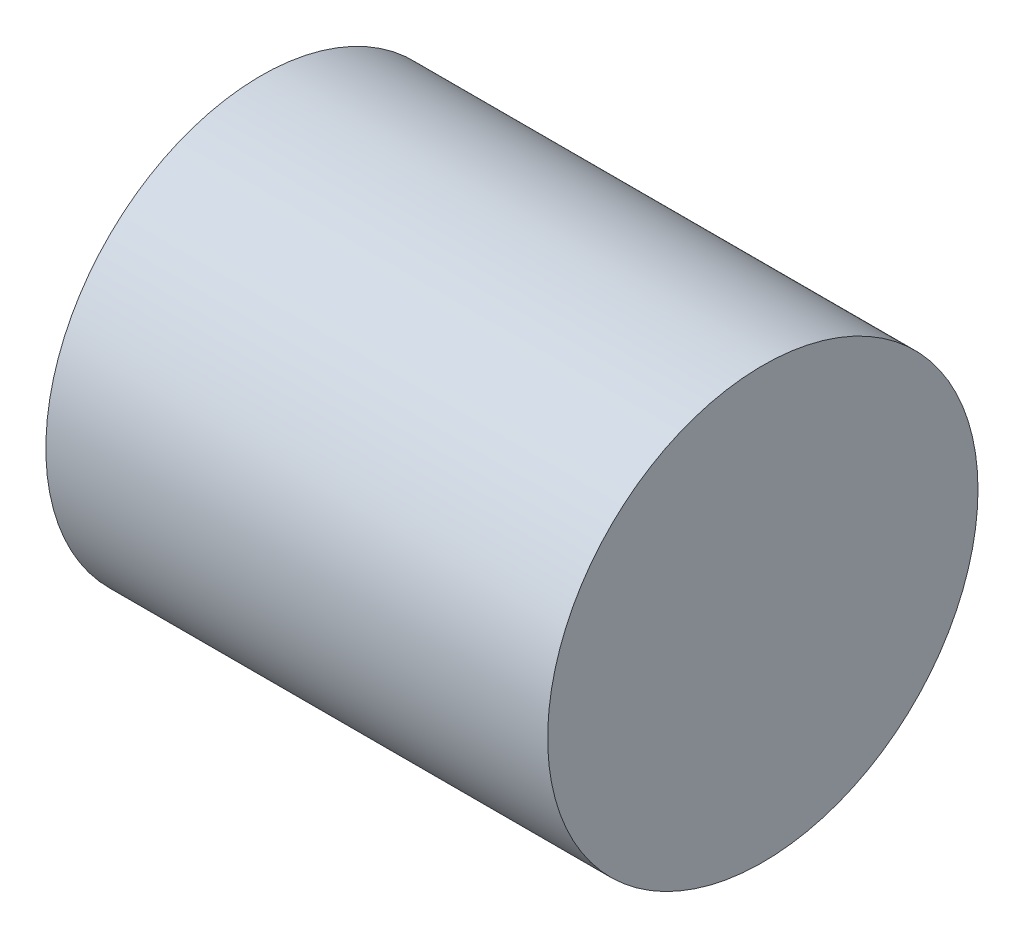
ISO-10303-21;
HEADER;
FILE_DESCRIPTION(('STEP AP214'),'2;1');
FILE_NAME('part.step','',(''),(''),'','','');
FILE_SCHEMA(('AUTOMOTIVE_DESIGN { 1 0 10303 214 1 1 1 1 }'));
ENDSEC;
DATA;
#1=APPLICATION_CONTEXT('core data for automotive mechanical design processes');
#2=APPLICATION_PROTOCOL_DEFINITION('international standard','automotive_design',2000,#1);
#3=PRODUCT_CONTEXT('',#1,'mechanical');
#4=PRODUCT('Part','Part','',(#3));
#5=PRODUCT_RELATED_PRODUCT_CATEGORY('part','',(#4));
#6=PRODUCT_DEFINITION_FORMATION('','',#4);
#7=PRODUCT_DEFINITION_CONTEXT('part definition',#1,'design');
#8=PRODUCT_DEFINITION('design','',#6,#7);
#9=PRODUCT_DEFINITION_SHAPE('','',#8);
#10=(LENGTH_UNIT() NAMED_UNIT(*) SI_UNIT(.MILLI.,.METRE.));
#11=(NAMED_UNIT(*) PLANE_ANGLE_UNIT() SI_UNIT($,.RADIAN.));
#12=(NAMED_UNIT(*) SI_UNIT($,.STERADIAN.) SOLID_ANGLE_UNIT());
#13=UNCERTAINTY_MEASURE_WITH_UNIT(LENGTH_MEASURE(1.E-05),#10,'distance_accuracy_value','');
#14=(GEOMETRIC_REPRESENTATION_CONTEXT(3) GLOBAL_UNCERTAINTY_ASSIGNED_CONTEXT((#13)) GLOBAL_UNIT_ASSIGNED_CONTEXT((#10,
#11,#12)) REPRESENTATION_CONTEXT('',''));
#15=CARTESIAN_POINT('',(0.,0.,0.));
#16=DIRECTION('',(0.,0.,1.));
#17=DIRECTION('',(1.,0.,0.));
#18=AXIS2_PLACEMENT_3D('',#15,#16,#17);
#19=CARTESIAN_POINT('',(9.230000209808,0.,4.8));
#20=DIRECTION('',(1.,0.,0.));
#21=DIRECTION('',(0.,0.,-1.));
#22=AXIS2_PLACEMENT_3D('',#19,#20,#21);
#23=PLANE('',#22);
#24=CARTESIAN_POINT('',(9.230000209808,0.,4.8));
#25=DIRECTION('',(1.,0.,0.));
#26=DIRECTION('',(0.,0.,-1.));
#27=AXIS2_PLACEMENT_3D('',#24,#25,#26);
#28=CIRCLE('',#27,2.799999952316);
#29=CARTESIAN_POINT('',(9.230000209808,0.,2.000000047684));
#30=VERTEX_POINT('',#29);
#31=EDGE_CURVE('E17',#30,#30,#28,.F.);
#32=ORIENTED_EDGE('',*,*,#31,.F.);
#33=EDGE_LOOP('',(#32));
#34=FACE_BOUND('',#33,.T.);
#35=ADVANCED_FACE('F14',(#34),#23,.T.);
#36=CARTESIAN_POINT('',(2.7,0.,4.8));
#37=DIRECTION('',(1.,0.,0.));
#38=DIRECTION('',(0.,0.,-1.));
#39=AXIS2_PLACEMENT_3D('',#36,#37,#38);
#40=PLANE('',#39);
#41=CARTESIAN_POINT('',(2.7,0.,4.8));
#42=DIRECTION('',(1.,0.,0.));
#43=DIRECTION('',(0.,0.,-1.));
#44=AXIS2_PLACEMENT_3D('',#41,#42,#43);
#45=CIRCLE('',#44,2.799999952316);
#46=CARTESIAN_POINT('',(2.7,0.,2.000000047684));
#47=VERTEX_POINT('',#46);
#48=EDGE_CURVE('E9',#47,#47,#45,.T.);
#49=ORIENTED_EDGE('',*,*,#48,.F.);
#50=EDGE_LOOP('',(#49));
#51=FACE_BOUND('',#50,.T.);
#52=ADVANCED_FACE('F29',(#51),#40,.F.);
#53=CARTESIAN_POINT('',(2.7,0.,4.8));
#54=DIRECTION('',(1.,0.,0.));
#55=DIRECTION('',(0.,0.,-1.));
#56=AXIS2_PLACEMENT_3D('',#53,#54,#55);
#57=CYLINDRICAL_SURFACE('',#56,2.799999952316);
#58=ORIENTED_EDGE('',*,*,#48,.T.);
#59=EDGE_LOOP('',(#58));
#60=FACE_BOUND('',#59,.T.);
#61=ORIENTED_EDGE('',*,*,#31,.T.);
#62=EDGE_LOOP('',(#61));
#63=FACE_BOUND('',#62,.T.);
#64=ADVANCED_FACE('F26',(#60,#63),#57,.T.);
#65=CLOSED_SHELL('',(#35,#52,#64));
#66=MANIFOLD_SOLID_BREP('B1',#65);
#67=ADVANCED_BREP_SHAPE_REPRESENTATION('',(#18,#66),#14);
#68=SHAPE_DEFINITION_REPRESENTATION(#9,#67);
ENDSEC;
END-ISO-10303-21;
